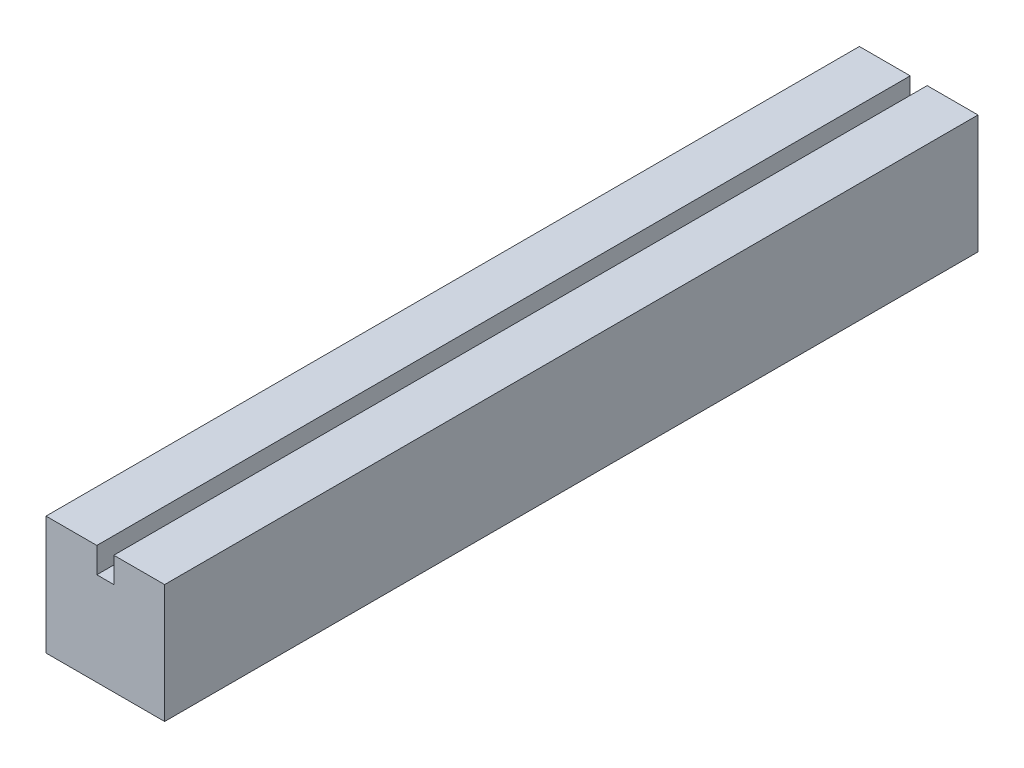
from build123d import *

# Parameters (mm, degrees)
BOSS_EXTRUDE1_DEPTH = 609.6


with BuildPart() as part:
    # Sketch1 → Boss-Extrude1 (new body)
    with BuildSketch(Plane.XY):
        Polygon((-6.35, 44.45), (-44.45, 44.45), (-44.45, -44.45), (44.45, -44.45), (44.45, 44.45), (6.35, 44.45), (6.35, 25.4), (-6.35, 25.4), align=None)
    extrude(amount=BOSS_EXTRUDE1_DEPTH)


solid = part.part
